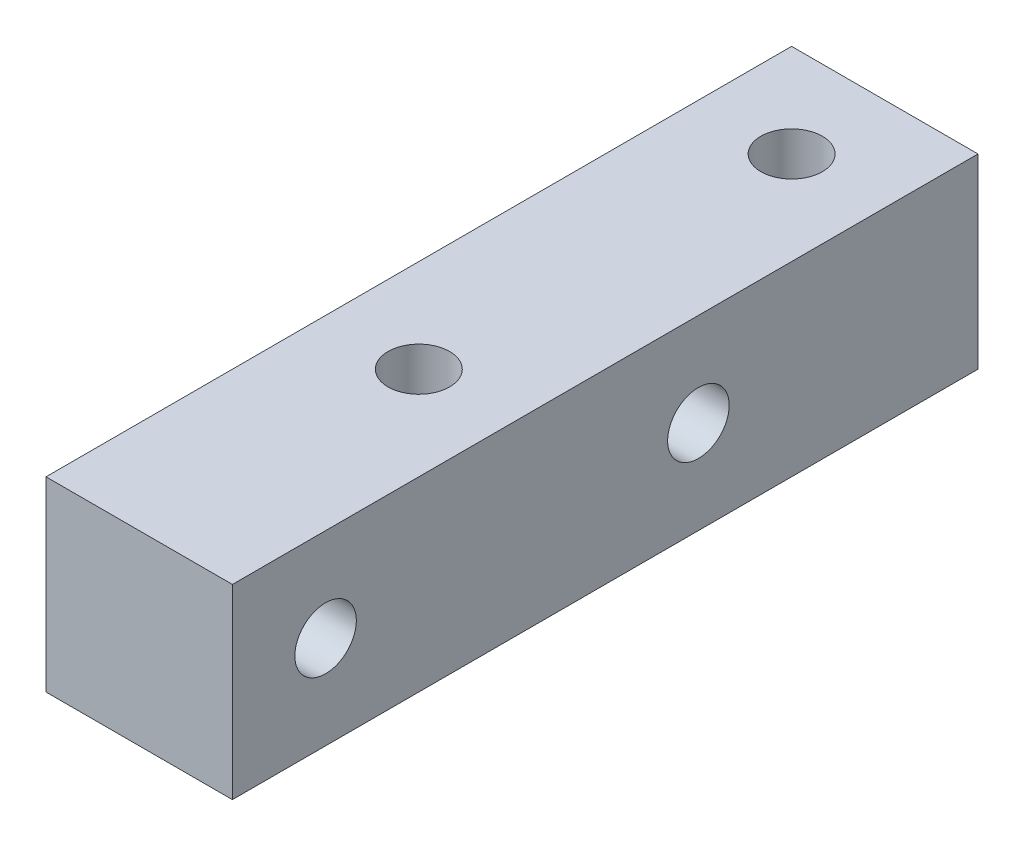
from build123d import *

# Parameters (mm, degrees)
SKETCH_1_W         = 10
SKETCH_1_H         = 10
EXTRUDE_1_DEPTH    = 40
HOLE_WIZARD_M4_1_D = 3.3
HOLE_WIZARD_M4_2_D = 3.3


with BuildPart() as part:
    # Sketch 1 → Extrude 1 (new body)
    with BuildSketch(Plane.XY):
        Rectangle(SKETCH_1_W, SKETCH_1_H)
    extrude(amount=EXTRUDE_1_DEPTH)

    # Hole Wizard M4 _1 (through all)
    with Locations(Plane(origin=(0, 5, 0), x_dir=(1, 0, 0), z_dir=(0, 1, 0))):
        with Locations((0, -5), (0, -25)):
            Hole(HOLE_WIZARD_M4_1_D / 2)

    # Hole Wizard M4 _2 (through all)
    with Locations(Plane(origin=(5, 0, 0), x_dir=(0, 0, -1), z_dir=(1, 0, 0))):
        with Locations((-35, 0), (-15, 0)):
            Hole(HOLE_WIZARD_M4_2_D / 2)


solid = part.part
